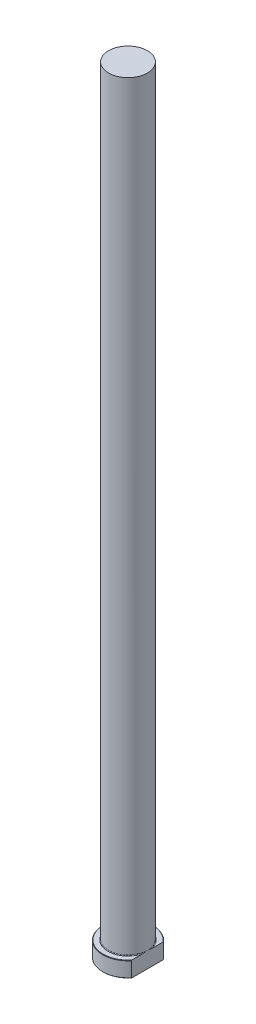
ISO-10303-21;
HEADER;
FILE_DESCRIPTION(('STEP AP214'),'2;1');
FILE_NAME('part.step','',(''),(''),'','','');
FILE_SCHEMA(('AUTOMOTIVE_DESIGN { 1 0 10303 214 1 1 1 1 }'));
ENDSEC;
DATA;
#1=APPLICATION_CONTEXT('core data for automotive mechanical design processes');
#2=APPLICATION_PROTOCOL_DEFINITION('international standard','automotive_design',2000,#1);
#3=PRODUCT_CONTEXT('',#1,'mechanical');
#4=PRODUCT('Part','Part','',(#3));
#5=PRODUCT_RELATED_PRODUCT_CATEGORY('part','',(#4));
#6=PRODUCT_DEFINITION_FORMATION('','',#4);
#7=PRODUCT_DEFINITION_CONTEXT('part definition',#1,'design');
#8=PRODUCT_DEFINITION('design','',#6,#7);
#9=PRODUCT_DEFINITION_SHAPE('','',#8);
#10=(LENGTH_UNIT() NAMED_UNIT(*) SI_UNIT(.MILLI.,.METRE.));
#11=(NAMED_UNIT(*) PLANE_ANGLE_UNIT() SI_UNIT($,.RADIAN.));
#12=(NAMED_UNIT(*) SI_UNIT($,.STERADIAN.) SOLID_ANGLE_UNIT());
#13=UNCERTAINTY_MEASURE_WITH_UNIT(LENGTH_MEASURE(1.E-05),#10,'distance_accuracy_value','');
#14=(GEOMETRIC_REPRESENTATION_CONTEXT(3) GLOBAL_UNCERTAINTY_ASSIGNED_CONTEXT((#13)) GLOBAL_UNIT_ASSIGNED_CONTEXT((#10,
#11,#12)) REPRESENTATION_CONTEXT('',''));
#15=CARTESIAN_POINT('',(0.,0.,0.));
#16=DIRECTION('',(0.,0.,1.));
#17=DIRECTION('',(1.,0.,0.));
#18=AXIS2_PLACEMENT_3D('',#15,#16,#17);
#19=CARTESIAN_POINT('',(0.,0.,0.));
#20=DIRECTION('',(0.,-1.,0.));
#21=DIRECTION('',(0.,0.,-1.));
#22=AXIS2_PLACEMENT_3D('',#19,#20,#21);
#23=PLANE('',#22);
#24=CARTESIAN_POINT('',(0.,0.,0.));
#25=DIRECTION('',(0.,-1.,0.));
#26=DIRECTION('',(0.,0.,-1.));
#27=AXIS2_PLACEMENT_3D('',#24,#25,#26);
#28=CIRCLE('',#27,12.7999999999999);
#29=CARTESIAN_POINT('',(9.99999999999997,0.,7.98999374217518));
#30=VERTEX_POINT('',#29);
#31=CARTESIAN_POINT('',(9.99999999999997,0.,-7.98999374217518));
#32=VERTEX_POINT('',#31);
#33=EDGE_CURVE('E98',#30,#32,#28,.T.);
#34=ORIENTED_EDGE('',*,*,#33,.T.);
#35=DIRECTION('',(0.,0.,1.));
#36=VECTOR('',#35,1.);
#37=CARTESIAN_POINT('',(9.99999999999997,0.,-8.30662386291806));
#38=LINE('',#37,#36);
#39=EDGE_CURVE('E83',#32,#30,#38,.T.);
#40=ORIENTED_EDGE('',*,*,#39,.T.);
#41=EDGE_LOOP('',(#34,#40));
#42=FACE_BOUND('',#41,.T.);
#43=ADVANCED_FACE('F32',(#42),#23,.T.);
#44=CARTESIAN_POINT('',(0.,259.958771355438,0.));
#45=DIRECTION('',(0.,1.,0.));
#46=DIRECTION('',(0.,0.,1.));
#47=AXIS2_PLACEMENT_3D('',#44,#45,#46);
#48=CYLINDRICAL_SURFACE('',#47,13.);
#49=CARTESIAN_POINT('',(0.,7.79999999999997,0.));
#50=DIRECTION('',(0.,1.,0.));
#51=DIRECTION('',(0.,0.,1.));
#52=AXIS2_PLACEMENT_3D('',#49,#50,#51);
#53=CIRCLE('',#52,13.);
#54=CARTESIAN_POINT('',(9.99999999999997,7.79999999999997,8.30662386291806));
#55=VERTEX_POINT('',#54);
#56=CARTESIAN_POINT('',(9.99999999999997,7.79999999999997,-8.30662386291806));
#57=VERTEX_POINT('',#56);
#58=EDGE_CURVE('E104',#55,#57,#53,.F.);
#59=ORIENTED_EDGE('',*,*,#58,.T.);
#60=DIRECTION('',(0.,-1.,0.));
#61=VECTOR('',#60,1.);
#62=CARTESIAN_POINT('',(9.99999999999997,400.,-8.30662386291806));
#63=LINE('',#62,#61);
#64=CARTESIAN_POINT('',(9.99999999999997,0.200000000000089,-8.30662386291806));
#65=VERTEX_POINT('',#64);
#66=EDGE_CURVE('E183',#57,#65,#63,.T.);
#67=ORIENTED_EDGE('',*,*,#66,.T.);
#68=CARTESIAN_POINT('',(0.,0.200000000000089,0.));
#69=DIRECTION('',(0.,-1.,0.));
#70=DIRECTION('',(0.,0.,-1.));
#71=AXIS2_PLACEMENT_3D('',#68,#69,#70);
#72=CIRCLE('',#71,13.);
#73=CARTESIAN_POINT('',(9.99999999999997,0.200000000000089,8.30662386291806));
#74=VERTEX_POINT('',#73);
#75=EDGE_CURVE('E100',#65,#74,#72,.F.);
#76=ORIENTED_EDGE('',*,*,#75,.T.);
#77=DIRECTION('',(0.,-1.,0.));
#78=VECTOR('',#77,1.);
#79=CARTESIAN_POINT('',(9.99999999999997,400.,8.30662386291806));
#80=LINE('',#79,#78);
#81=EDGE_CURVE('E93',#55,#74,#80,.T.);
#82=ORIENTED_EDGE('',*,*,#81,.F.);
#83=EDGE_LOOP('',(#59,#67,#76,#82));
#84=FACE_BOUND('',#83,.T.);
#85=ADVANCED_FACE('F158',(#84),#48,.T.);
#86=CARTESIAN_POINT('',(-13.,8.,0.));
#87=DIRECTION('',(0.,1.,0.));
#88=DIRECTION('',(0.,0.,1.));
#89=AXIS2_PLACEMENT_3D('',#86,#87,#88);
#90=PLANE('',#89);
#91=CARTESIAN_POINT('',(0.,8.,0.));
#92=DIRECTION('',(0.,1.,0.));
#93=DIRECTION('',(0.,0.,1.));
#94=AXIS2_PLACEMENT_3D('',#91,#92,#93);
#95=CIRCLE('',#94,12.8);
#96=CARTESIAN_POINT('',(9.99999999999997,8.,-7.98999374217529));
#97=VERTEX_POINT('',#96);
#98=CARTESIAN_POINT('',(9.99999999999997,8.,7.98999374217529));
#99=VERTEX_POINT('',#98);
#100=EDGE_CURVE('E178',#97,#99,#95,.T.);
#101=ORIENTED_EDGE('',*,*,#100,.T.);
#102=DIRECTION('',(0.,0.,-1.));
#103=VECTOR('',#102,1.);
#104=CARTESIAN_POINT('',(9.99999999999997,8.,0.));
#105=LINE('',#104,#103);
#106=CARTESIAN_POINT('',(9.99999999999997,7.99999999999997,2.46779253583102));
#107=VERTEX_POINT('',#106);
#108=EDGE_CURVE('E57',#99,#107,#105,.T.);
#109=ORIENTED_EDGE('',*,*,#108,.T.);
#110=CARTESIAN_POINT('',(0.,8.,0.));
#111=DIRECTION('',(0.,1.,0.));
#112=DIRECTION('',(0.,0.,1.));
#113=AXIS2_PLACEMENT_3D('',#110,#111,#112);
#114=CIRCLE('',#113,10.3);
#115=CARTESIAN_POINT('',(9.99999999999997,7.99999999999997,-2.4677925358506));
#116=VERTEX_POINT('',#115);
#117=EDGE_CURVE('E107',#107,#116,#114,.F.);
#118=ORIENTED_EDGE('',*,*,#117,.T.);
#119=EDGE_CURVE('E136',#116,#97,#105,.T.);
#120=ORIENTED_EDGE('',*,*,#119,.T.);
#121=EDGE_LOOP('',(#101,#109,#118,#120));
#122=FACE_BOUND('',#121,.T.);
#123=ADVANCED_FACE('F147',(#122),#90,.T.);
#124=CARTESIAN_POINT('',(0.,8.00000000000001,0.));
#125=DIRECTION('',(0.,-1.,0.));
#126=DIRECTION('',(0.,0.,-1.));
#127=AXIS2_PLACEMENT_3D('',#124,#125,#126);
#128=CONICAL_SURFACE('',#127,12.8,0.78539816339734);
#129=ORIENTED_EDGE('',*,*,#58,.F.);
#130=CARTESIAN_POINT('',(9.99999999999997,-0.0325156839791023,18.2754947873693));
#131=CARTESIAN_POINT('',(9.99999999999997,0.202654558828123,18.0074110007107));
#132=CARTESIAN_POINT('',(9.99999999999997,0.437161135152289,17.7387434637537));
#133=CARTESIAN_POINT('',(9.99999999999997,0.90465320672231,17.2000818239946));
#134=CARTESIAN_POINT('',(9.99999999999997,1.1376386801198,16.9300877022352));
#135=CARTESIAN_POINT('',(9.99999999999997,1.60198918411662,16.3885035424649));
#136=CARTESIAN_POINT('',(9.99999999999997,1.83335346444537,16.1169128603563));
#137=CARTESIAN_POINT('',(9.99999999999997,2.29410614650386,15.5720644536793));
#138=CARTESIAN_POINT('',(9.99999999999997,2.52349455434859,15.2988067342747));
#139=CARTESIAN_POINT('',(9.99999999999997,3.21725580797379,14.465453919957));
#140=CARTESIAN_POINT('',(9.99999999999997,3.67808931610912,13.9023903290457));
#141=CARTESIAN_POINT('',(9.99999999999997,4.35978968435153,13.0502618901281));
#142=CARTESIAN_POINT('',(9.99999999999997,4.58540795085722,12.7649943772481));
#143=CARTESIAN_POINT('',(9.99999999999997,5.03290011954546,12.1915402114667));
#144=CARTESIAN_POINT('',(9.99999999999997,5.25477408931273,11.9033536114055));
#145=CARTESIAN_POINT('',(9.99999999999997,5.69431250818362,11.3233226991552));
#146=CARTESIAN_POINT('',(9.99999999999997,5.91197246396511,11.0314749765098));
#147=CARTESIAN_POINT('',(9.99999999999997,6.3419766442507,10.4438760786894));
#148=CARTESIAN_POINT('',(9.99999999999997,6.55432081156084,10.1481248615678));
#149=CARTESIAN_POINT('',(9.99999999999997,6.97275454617,9.55185224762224));
#150=CARTESIAN_POINT('',(9.99999999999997,7.1788387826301,9.25132709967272));
#151=CARTESIAN_POINT('',(9.99999999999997,7.58314110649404,8.6450223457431));
#152=CARTESIAN_POINT('',(9.99999999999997,7.78135936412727,8.33924285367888));
#153=CARTESIAN_POINT('',(9.99999999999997,8.1669913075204,7.72335702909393));
#154=CARTESIAN_POINT('',(9.99999999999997,8.35446043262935,7.41328556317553));
#155=CARTESIAN_POINT('',(9.99999999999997,8.71750578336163,6.78616658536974));
#156=CARTESIAN_POINT('',(9.99999999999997,8.89308056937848,6.46911823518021));
#157=CARTESIAN_POINT('',(9.99999999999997,9.22907765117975,5.82759086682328));
#158=CARTESIAN_POINT('',(9.99999999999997,9.38952050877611,5.50312269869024));
#159=CARTESIAN_POINT('',(9.99999999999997,9.69166927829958,4.84563633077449));
#160=CARTESIAN_POINT('',(9.99999999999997,9.83338220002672,4.5126213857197));
#161=CARTESIAN_POINT('',(9.99999999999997,10.096522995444,3.82962418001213));
#162=CARTESIAN_POINT('',(9.99999999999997,10.2174003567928,3.47942732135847));
#163=CARTESIAN_POINT('',(9.99999999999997,10.4289934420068,2.76986167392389));
#164=CARTESIAN_POINT('',(9.99999999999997,10.5197138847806,2.41049432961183));
#165=CARTESIAN_POINT('',(9.99999999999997,10.6286544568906,1.86748514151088));
#166=CARTESIAN_POINT('',(9.99999999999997,10.6603769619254,1.68649705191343));
#167=CARTESIAN_POINT('',(9.99999999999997,10.7144435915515,1.32313476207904));
#168=CARTESIAN_POINT('',(9.99999999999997,10.7367891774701,1.14076078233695));
#169=CARTESIAN_POINT('',(9.99999999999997,10.7716587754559,0.775084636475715));
#170=CARTESIAN_POINT('',(9.99999999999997,10.7841833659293,0.591782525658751));
#171=CARTESIAN_POINT('',(9.99999999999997,10.7991548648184,0.224764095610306));
#172=CARTESIAN_POINT('',(9.99999999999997,10.8016017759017,0.0410477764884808));
#173=CARTESIAN_POINT('',(9.99999999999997,10.7963538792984,-0.32701731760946));
#174=CARTESIAN_POINT('',(9.99999999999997,10.7886160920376,-0.511365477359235));
#175=CARTESIAN_POINT('',(9.99999999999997,10.7630873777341,-0.879387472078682));
#176=CARTESIAN_POINT('',(9.99999999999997,10.7452949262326,-1.06306120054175));
#177=CARTESIAN_POINT('',(9.99999999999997,10.7000178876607,-1.42920996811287));
#178=CARTESIAN_POINT('',(9.99999999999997,10.6725330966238,-1.61168498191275));
#179=CARTESIAN_POINT('',(9.99999999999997,10.6083992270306,-1.97502817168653));
#180=CARTESIAN_POINT('',(9.99999999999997,10.5717486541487,-2.15589608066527));
#181=CARTESIAN_POINT('',(9.99999999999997,10.4483311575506,-2.69844589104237));
#182=CARTESIAN_POINT('',(9.99999999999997,10.3484702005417,-3.0571987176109));
#183=CARTESIAN_POINT('',(9.99999999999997,10.1199208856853,-3.76518322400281));
#184=CARTESIAN_POINT('',(9.99999999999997,9.99123071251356,-4.11441430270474));
#185=CARTESIAN_POINT('',(9.99999999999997,9.68849468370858,-4.85781703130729));
#186=CARTESIAN_POINT('',(9.99999999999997,9.51049481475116,-5.25036497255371));
#187=CARTESIAN_POINT('',(9.99999999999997,9.13067200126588,-6.0238543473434));
#188=CARTESIAN_POINT('',(9.99999999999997,8.92883580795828,-6.40478917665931));
#189=CARTESIAN_POINT('',(9.99999999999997,8.50660482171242,-7.15714025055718));
#190=CARTESIAN_POINT('',(9.99999999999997,8.28617401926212,-7.52853612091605));
#191=CARTESIAN_POINT('',(9.99999999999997,7.83133827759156,-8.26251132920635));
#192=CARTESIAN_POINT('',(9.99999999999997,7.59693601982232,-8.62509234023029));
#193=CARTESIAN_POINT('',(9.99999999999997,7.11586721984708,-9.34492022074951));
#194=CARTESIAN_POINT('',(9.99999999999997,6.86913954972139,-9.7021260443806));
#195=CARTESIAN_POINT('',(9.99999999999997,6.36695123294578,-10.4103413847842));
#196=CARTESIAN_POINT('',(9.99999999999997,6.11149026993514,-10.7613506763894));
#197=CARTESIAN_POINT('',(9.99999999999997,5.59387477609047,-11.4577672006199));
#198=CARTESIAN_POINT('',(9.99999999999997,5.33172815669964,-11.803180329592));
#199=CARTESIAN_POINT('',(9.99999999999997,4.80177954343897,-12.4896197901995));
#200=CARTESIAN_POINT('',(9.99999999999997,4.53397765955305,-12.8306462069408));
#201=CARTESIAN_POINT('',(9.99999999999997,3.91508653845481,-13.6077378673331));
#202=CARTESIAN_POINT('',(9.99999999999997,3.56244770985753,-14.0425677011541));
#203=CARTESIAN_POINT('',(9.99999999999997,2.85099084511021,-14.9072873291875));
#204=CARTESIAN_POINT('',(9.99999999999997,2.49217148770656,-15.3371760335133));
#205=CARTESIAN_POINT('',(9.99999999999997,1.77449197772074,-16.1870689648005));
#206=CARTESIAN_POINT('',(9.99999999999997,1.41569709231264,-16.607128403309));
#207=CARTESIAN_POINT('',(9.99999999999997,0.694277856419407,-17.4437464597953));
#208=CARTESIAN_POINT('',(9.99999999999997,0.331654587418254,-17.8603060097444));
#209=CARTESIAN_POINT('',(9.99999999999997,-0.0325156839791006,-18.2754947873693));
#210=B_SPLINE_CURVE_WITH_KNOTS('',3,(#130,#131,#132,#133,#134,#135,#136,#137,#138,#139,#140,
#141,#142,#143,#144,#145,#146,#147,#148,#149,#150,#151,#152,#153,#154,#155,#156,#157,#158,#159,
#160,#161,#162,#163,#164,#165,#166,#167,#168,#169,#170,#171,#172,#173,#174,#175,#176,#177,#178,
#179,#180,#181,#182,#183,#184,#185,#186,#187,#188,#189,#190,#191,#192,#193,#194,#195,#196,#197,
#198,#199,#200,#201,#202,#203,#204,#205,#206,#207,#208,#209),.UNSPECIFIED.,.F.,.F.,(4,2,2,2,2,2,
2,2,2,2,2,2,2,2,2,2,2,2,2,2,2,2,2,2,2,2,2,2,2,2,2,2,2,2,2,2,2,2,2,4),(0.,1.06984422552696,
2.13970378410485,3.21002948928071,4.28035188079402,6.46299853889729,7.55408928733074,
8.64516032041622,9.73733693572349,10.8295252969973,11.9226190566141,13.0156891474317,
14.1024911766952,15.1894245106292,16.2748589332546,17.3598859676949,18.4702319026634,
19.5804040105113,20.1314403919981,20.6823908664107,21.2333088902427,21.7842267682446,
22.3374769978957,22.890811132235,23.4441569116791,23.9975929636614,25.1131246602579,
26.2287266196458,27.520697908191,28.8133907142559,30.1086470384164,31.4036555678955,
32.7058891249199,34.0081699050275,35.3089752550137,36.6097553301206,38.2892289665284,
39.9690662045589,41.6263430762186,43.2831636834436),.UNSPECIFIED.);
#211=EDGE_CURVE('E135',#55,#99,#210,.T.);
#212=ORIENTED_EDGE('',*,*,#211,.T.);
#213=ORIENTED_EDGE('',*,*,#100,.F.);
#214=EDGE_CURVE('E127',#97,#57,#210,.T.);
#215=ORIENTED_EDGE('',*,*,#214,.T.);
#216=EDGE_LOOP('',(#129,#212,#213,#215));
#217=FACE_BOUND('',#216,.T.);
#218=ADVANCED_FACE('F143',(#217),#128,.T.);
#219=CARTESIAN_POINT('',(0.,0.200000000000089,0.));
#220=DIRECTION('',(0.,1.,0.));
#221=DIRECTION('',(0.,0.,1.));
#222=AXIS2_PLACEMENT_3D('',#219,#220,#221);
#223=CONICAL_SURFACE('',#222,13.,0.78539816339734);
#224=ORIENTED_EDGE('',*,*,#75,.F.);
#225=CARTESIAN_POINT('',(9.99999999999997,8.03251568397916,-18.2754947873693));
#226=CARTESIAN_POINT('',(9.99999999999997,7.79734544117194,-18.0074110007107));
#227=CARTESIAN_POINT('',(9.99999999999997,7.56283886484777,-17.7387434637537));
#228=CARTESIAN_POINT('',(9.99999999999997,7.09534679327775,-17.2000818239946));
#229=CARTESIAN_POINT('',(9.99999999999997,6.86236131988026,-16.9300877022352));
#230=CARTESIAN_POINT('',(9.99999999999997,6.39801081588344,-16.3885035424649));
#231=CARTESIAN_POINT('',(9.99999999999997,6.1666465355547,-16.1169128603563));
#232=CARTESIAN_POINT('',(9.99999999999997,5.7058938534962,-15.5720644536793));
#233=CARTESIAN_POINT('',(9.99999999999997,5.47650544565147,-15.2988067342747));
#234=CARTESIAN_POINT('',(9.99999999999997,4.78274419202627,-14.465453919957));
#235=CARTESIAN_POINT('',(9.99999999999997,4.32191068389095,-13.9023903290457));
#236=CARTESIAN_POINT('',(9.99999999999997,3.64021031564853,-13.050261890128));
#237=CARTESIAN_POINT('',(9.99999999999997,3.41459204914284,-12.7649943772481));
#238=CARTESIAN_POINT('',(9.99999999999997,2.96709988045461,-12.1915402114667));
#239=CARTESIAN_POINT('',(9.99999999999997,2.74522591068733,-11.9033536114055));
#240=CARTESIAN_POINT('',(9.99999999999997,2.30568749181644,-11.3233226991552));
#241=CARTESIAN_POINT('',(9.99999999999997,2.08802753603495,-11.0314749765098));
#242=CARTESIAN_POINT('',(9.99999999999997,1.65802335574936,-10.4438760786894));
#243=CARTESIAN_POINT('',(9.99999999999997,1.44567918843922,-10.1481248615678));
#244=CARTESIAN_POINT('',(9.99999999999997,1.02724545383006,-9.55185224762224));
#245=CARTESIAN_POINT('',(9.99999999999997,0.821161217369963,-9.25132709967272));
#246=CARTESIAN_POINT('',(9.99999999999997,0.416858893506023,-8.6450223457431));
#247=CARTESIAN_POINT('',(9.99999999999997,0.218640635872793,-8.33924285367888));
#248=CARTESIAN_POINT('',(9.99999999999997,-0.16699130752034,-7.72335702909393));
#249=CARTESIAN_POINT('',(9.99999999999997,-0.354460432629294,-7.41328556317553));
#250=CARTESIAN_POINT('',(9.99999999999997,-0.71750578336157,-6.78616658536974));
#251=CARTESIAN_POINT('',(9.99999999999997,-0.893080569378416,-6.4691182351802));
#252=CARTESIAN_POINT('',(9.99999999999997,-1.22907765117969,-5.82759086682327));
#253=CARTESIAN_POINT('',(9.99999999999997,-1.38952050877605,-5.50312269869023));
#254=CARTESIAN_POINT('',(9.99999999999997,-1.69166927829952,-4.84563633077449));
#255=CARTESIAN_POINT('',(9.99999999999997,-1.83338220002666,-4.5126213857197));
#256=CARTESIAN_POINT('',(9.99999999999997,-2.09652299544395,-3.82962418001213));
#257=CARTESIAN_POINT('',(9.99999999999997,-2.21740035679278,-3.47942732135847));
#258=CARTESIAN_POINT('',(9.99999999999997,-2.4289934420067,-2.76986167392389));
#259=CARTESIAN_POINT('',(9.99999999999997,-2.51971388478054,-2.41049432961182));
#260=CARTESIAN_POINT('',(9.99999999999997,-2.62865445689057,-1.86748514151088));
#261=CARTESIAN_POINT('',(9.99999999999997,-2.66037696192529,-1.68649705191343));
#262=CARTESIAN_POINT('',(9.99999999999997,-2.71444359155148,-1.32313476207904));
#263=CARTESIAN_POINT('',(9.99999999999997,-2.73678917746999,-1.14076078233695));
#264=CARTESIAN_POINT('',(9.99999999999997,-2.77165877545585,-0.775084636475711));
#265=CARTESIAN_POINT('',(9.99999999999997,-2.78418336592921,-0.591782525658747));
#266=CARTESIAN_POINT('',(9.99999999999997,-2.79915486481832,-0.224764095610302));
#267=CARTESIAN_POINT('',(9.99999999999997,-2.80160177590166,-0.0410477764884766));
#268=CARTESIAN_POINT('',(9.99999999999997,-2.79635387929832,0.327017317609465));
#269=CARTESIAN_POINT('',(9.99999999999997,-2.78861609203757,0.51136547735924));
#270=CARTESIAN_POINT('',(9.99999999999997,-2.76308737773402,0.879387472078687));
#271=CARTESIAN_POINT('',(9.99999999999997,-2.74529492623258,1.06306120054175));
#272=CARTESIAN_POINT('',(9.99999999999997,-2.70001788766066,1.42920996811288));
#273=CARTESIAN_POINT('',(9.99999999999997,-2.67253309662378,1.61168498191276));
#274=CARTESIAN_POINT('',(9.99999999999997,-2.60839922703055,1.97502817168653));
#275=CARTESIAN_POINT('',(9.99999999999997,-2.57174865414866,2.15589608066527));
#276=CARTESIAN_POINT('',(9.99999999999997,-2.44833115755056,2.69844589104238));
#277=CARTESIAN_POINT('',(9.99999999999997,-2.34847020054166,3.0571987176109));
#278=CARTESIAN_POINT('',(9.99999999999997,-2.11992088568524,3.76518322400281));
#279=CARTESIAN_POINT('',(9.99999999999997,-1.9912307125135,4.11441430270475));
#280=CARTESIAN_POINT('',(9.99999999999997,-1.68849468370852,4.85781703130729));
#281=CARTESIAN_POINT('',(9.99999999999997,-1.5104948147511,5.25036497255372));
#282=CARTESIAN_POINT('',(9.99999999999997,-1.13067200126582,6.0238543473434));
#283=CARTESIAN_POINT('',(9.99999999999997,-0.928835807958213,6.40478917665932));
#284=CARTESIAN_POINT('',(9.99999999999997,-0.506604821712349,7.15714025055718));
#285=CARTESIAN_POINT('',(9.99999999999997,-0.286174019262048,7.52853612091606));
#286=CARTESIAN_POINT('',(9.99999999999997,0.168661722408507,8.26251132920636));
#287=CARTESIAN_POINT('',(9.99999999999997,0.403063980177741,8.6250923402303));
#288=CARTESIAN_POINT('',(9.99999999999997,0.884132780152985,9.34492022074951));
#289=CARTESIAN_POINT('',(9.99999999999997,1.13086045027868,9.70212604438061));
#290=CARTESIAN_POINT('',(9.99999999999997,1.63304876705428,10.4103413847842));
#291=CARTESIAN_POINT('',(9.99999999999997,1.88850973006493,10.7613506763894));
#292=CARTESIAN_POINT('',(9.99999999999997,2.4061252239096,11.4577672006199));
#293=CARTESIAN_POINT('',(9.99999999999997,2.66827184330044,11.803180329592));
#294=CARTESIAN_POINT('',(9.99999999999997,3.1982204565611,12.4896197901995));
#295=CARTESIAN_POINT('',(9.99999999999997,3.46602234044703,12.8306462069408));
#296=CARTESIAN_POINT('',(9.99999999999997,4.08491346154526,13.6077378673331));
#297=CARTESIAN_POINT('',(9.99999999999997,4.43755229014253,14.0425677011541));
#298=CARTESIAN_POINT('',(9.99999999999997,5.14900915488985,14.9072873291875));
#299=CARTESIAN_POINT('',(9.99999999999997,5.5078285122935,15.3371760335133));
#300=CARTESIAN_POINT('',(9.99999999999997,6.22550802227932,16.1870689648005));
#301=CARTESIAN_POINT('',(9.99999999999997,6.58430290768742,16.607128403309));
#302=CARTESIAN_POINT('',(9.99999999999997,7.30572214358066,17.4437464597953));
#303=CARTESIAN_POINT('',(9.99999999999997,7.66834541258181,17.8603060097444));
#304=CARTESIAN_POINT('',(9.99999999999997,8.03251568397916,18.2754947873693));
#305=B_SPLINE_CURVE_WITH_KNOTS('',3,(#225,#226,#227,#228,#229,#230,#231,#232,#233,#234,#235,
#236,#237,#238,#239,#240,#241,#242,#243,#244,#245,#246,#247,#248,#249,#250,#251,#252,#253,#254,
#255,#256,#257,#258,#259,#260,#261,#262,#263,#264,#265,#266,#267,#268,#269,#270,#271,#272,#273,
#274,#275,#276,#277,#278,#279,#280,#281,#282,#283,#284,#285,#286,#287,#288,#289,#290,#291,#292,
#293,#294,#295,#296,#297,#298,#299,#300,#301,#302,#303,#304),.UNSPECIFIED.,.F.,.F.,(4,2,2,2,2,2,
2,2,2,2,2,2,2,2,2,2,2,2,2,2,2,2,2,2,2,2,2,2,2,2,2,2,2,2,2,2,2,2,2,4),(0.,1.06984422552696,
2.13970378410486,3.21002948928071,4.28035188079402,6.46299853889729,7.55408928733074,
8.64516032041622,9.73733693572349,10.8295252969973,11.9226190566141,13.0156891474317,
14.1024911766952,15.1894245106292,16.2748589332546,17.3598859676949,18.4702319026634,
19.5804040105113,20.1314403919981,20.6823908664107,21.2333088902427,21.7842267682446,
22.3374769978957,22.8908111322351,23.4441569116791,23.9975929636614,25.1131246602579,
26.2287266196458,27.520697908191,28.8133907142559,30.1086470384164,31.4036555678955,
32.7058891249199,34.0081699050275,35.3089752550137,36.6097553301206,38.2892289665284,
39.9690662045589,41.6263430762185,43.2831636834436),.UNSPECIFIED.);
#306=EDGE_CURVE('E86',#65,#32,#305,.T.);
#307=ORIENTED_EDGE('',*,*,#306,.T.);
#308=ORIENTED_EDGE('',*,*,#33,.F.);
#309=EDGE_CURVE('E89',#30,#74,#305,.T.);
#310=ORIENTED_EDGE('',*,*,#309,.T.);
#311=EDGE_LOOP('',(#224,#307,#308,#310));
#312=FACE_BOUND('',#311,.T.);
#313=ADVANCED_FACE('F97',(#312),#223,.T.);
#314=CARTESIAN_POINT('',(0.,8.29999999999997,0.));
#315=DIRECTION('',(0.,1.,0.));
#316=DIRECTION('',(0.,0.,1.));
#317=AXIS2_PLACEMENT_3D('',#314,#315,#316);
#318=TOROIDAL_SURFACE('',#317,10.3,0.3);
#319=CARTESIAN_POINT('',(9.99999999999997,8.29999999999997,0.));
#320=CARTESIAN_POINT('',(9.99999999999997,8.3000006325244,1.2894927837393E-10));
#321=CARTESIAN_POINT('',(9.99999999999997,8.30000126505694,-4.00092931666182E-07));
#322=CARTESIAN_POINT('',(9.99999999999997,8.30000243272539,-1.40234418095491E-06));
#323=CARTESIAN_POINT('',(9.99999999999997,8.30000291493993,-2.02945823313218E-06));
#324=CARTESIAN_POINT('',(9.99999999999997,8.30000399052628,-3.57386628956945E-06));
#325=CARTESIAN_POINT('',(9.99999999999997,8.30000456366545,-4.5158581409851E-06));
#326=CARTESIAN_POINT('',(9.99999999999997,8.30000552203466,-6.39352358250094E-06));
#327=CARTESIAN_POINT('',(9.99999999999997,8.3000059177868,-7.32481303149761E-06));
#328=CARTESIAN_POINT('',(9.99999999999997,8.30000752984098,-1.11866731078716E-05));
#329=CARTESIAN_POINT('',(9.99999999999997,8.30000869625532,-1.41456078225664E-05));
#330=CARTESIAN_POINT('',(9.99999999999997,8.30001046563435,-1.98041770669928E-05));
#331=CARTESIAN_POINT('',(9.99999999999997,8.30001112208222,-2.2487618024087E-05));
#332=CARTESIAN_POINT('',(9.99999999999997,8.30001410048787,-3.44834818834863E-05));
#333=CARTESIAN_POINT('',(9.99999999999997,8.30001652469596,-4.37702043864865E-05));
#334=CARTESIAN_POINT('',(9.99999999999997,8.30001986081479,-6.08623690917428E-05));
#335=CARTESIAN_POINT('',(9.99999999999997,8.30002096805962,-6.86285921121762E-05));
#336=CARTESIAN_POINT('',(9.99999999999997,8.3000293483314,-0.00012805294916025));
#337=CARTESIAN_POINT('',(9.99999999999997,8.30003610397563,-0.000179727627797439));
#338=CARTESIAN_POINT('',(9.99999999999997,8.30006561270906,-0.00038619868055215));
#339=CARTESIAN_POINT('',(9.99999999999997,8.30009331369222,-0.000540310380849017));
#340=CARTESIAN_POINT('',(9.99999999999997,8.30020264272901,-0.00115673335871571));
#341=CARTESIAN_POINT('',(9.99999999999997,8.30028138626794,-0.00161935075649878));
#342=CARTESIAN_POINT('',(9.99999999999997,8.30059961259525,-0.00347761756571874));
#343=CARTESIAN_POINT('',(9.99999999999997,8.30084290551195,-0.0048728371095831));
#344=CARTESIAN_POINT('',(9.99999999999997,8.30186502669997,-0.0107472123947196));
#345=CARTESIAN_POINT('',(9.99999999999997,8.30263902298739,-0.0152269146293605));
#346=CARTESIAN_POINT('',(9.99999999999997,8.31278939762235,-0.0739588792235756));
#347=CARTESIAN_POINT('',(9.99999999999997,8.32219581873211,-0.128207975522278));
#348=CARTESIAN_POINT('',(9.99999999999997,8.34198671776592,-0.242894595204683));
#349=CARTESIAN_POINT('',(9.99999999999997,8.35236068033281,-0.303333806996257));
#350=CARTESIAN_POINT('',(9.99999999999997,8.3697713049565,-0.405616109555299));
#351=CARTESIAN_POINT('',(9.99999999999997,8.3768514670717,-0.447451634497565));
#352=CARTESIAN_POINT('',(9.99999999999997,8.39069208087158,-0.529918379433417));
#353=CARTESIAN_POINT('',(9.99999999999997,8.39745582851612,-0.570549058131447));
#354=CARTESIAN_POINT('',(9.99999999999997,8.4352494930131,-0.799879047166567));
#355=CARTESIAN_POINT('',(9.99999999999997,8.46492511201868,-0.988816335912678));
#356=CARTESIAN_POINT('',(9.99999999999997,8.50514159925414,-1.27416595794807));
#357=CARTESIAN_POINT('',(9.99999999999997,8.51790226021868,-1.37026272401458));
#358=CARTESIAN_POINT('',(9.99999999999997,8.54137601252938,-1.56269877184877));
#359=CARTESIAN_POINT('',(9.99999999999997,8.55208934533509,-1.65903802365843));
#360=CARTESIAN_POINT('',(9.99999999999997,8.57171635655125,-1.86082905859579));
#361=CARTESIAN_POINT('',(9.99999999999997,8.58037484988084,-1.96630619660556));
#362=CARTESIAN_POINT('',(9.99999999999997,8.59347501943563,-2.17764173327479));
#363=CARTESIAN_POINT('',(9.99999999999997,8.59791297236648,-2.28350038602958));
#364=CARTESIAN_POINT('',(9.99999999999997,8.60018116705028,-2.44194031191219));
#365=CARTESIAN_POINT('',(9.99999999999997,8.60021412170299,-2.49449016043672));
#366=CARTESIAN_POINT('',(9.99999999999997,8.5985468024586,-2.59955991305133));
#367=CARTESIAN_POINT('',(9.99999999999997,8.59684676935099,-2.65207982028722));
#368=CARTESIAN_POINT('',(9.99999999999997,8.59132943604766,-2.7569292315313));
#369=CARTESIAN_POINT('',(9.99999999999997,8.58751547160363,-2.80925890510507));
#370=CARTESIAN_POINT('',(9.99999999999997,8.57721394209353,-2.91364681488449));
#371=CARTESIAN_POINT('',(9.99999999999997,8.57072778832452,-2.96570517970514));
#372=CARTESIAN_POINT('',(9.99999999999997,8.55845909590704,-3.04236198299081));
#373=CARTESIAN_POINT('',(9.99999999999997,8.55406015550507,-3.06718232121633));
#374=CARTESIAN_POINT('',(9.99999999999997,8.54426309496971,-3.11664708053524));
#375=CARTESIAN_POINT('',(9.99999999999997,8.53886425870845,-3.14129136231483));
#376=CARTESIAN_POINT('',(9.99999999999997,8.52688550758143,-3.19015398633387));
#377=CARTESIAN_POINT('',(9.99999999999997,8.52031210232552,-3.21437390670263));
#378=CARTESIAN_POINT('',(9.99999999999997,8.50565284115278,-3.26234404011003));
#379=CARTESIAN_POINT('',(9.99999999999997,8.49756823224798,-3.2860946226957));
#380=CARTESIAN_POINT('',(9.99999999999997,8.47930616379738,-3.33303874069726));
#381=CARTESIAN_POINT('',(9.99999999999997,8.46910978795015,-3.35622496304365));
#382=CARTESIAN_POINT('',(9.99999999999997,8.44583688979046,-3.40109767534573));
#383=CARTESIAN_POINT('',(9.99999999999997,8.43277518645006,-3.4227911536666));
#384=CARTESIAN_POINT('',(9.99999999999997,8.41234422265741,-3.44947282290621));
#385=CARTESIAN_POINT('',(9.99999999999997,8.40696910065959,-3.45597309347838));
#386=CARTESIAN_POINT('',(9.99999999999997,8.39560437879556,-3.46843629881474));
#387=CARTESIAN_POINT('',(9.99999999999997,8.38961405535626,-3.47439858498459));
#388=CARTESIAN_POINT('',(9.99999999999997,8.37686927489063,-3.48560282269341));
#389=CARTESIAN_POINT('',(9.99999999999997,8.37010747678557,-3.49083658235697));
#390=CARTESIAN_POINT('',(9.99999999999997,8.3558159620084,-3.50012893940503));
#391=CARTESIAN_POINT('',(9.99999999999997,8.34828839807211,-3.50419071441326));
#392=CARTESIAN_POINT('',(9.99999999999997,8.33495256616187,-3.50966904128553));
#393=CARTESIAN_POINT('',(9.99999999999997,8.32932210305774,-3.5115146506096));
#394=CARTESIAN_POINT('',(9.99999999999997,8.31783314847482,-3.51424608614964));
#395=CARTESIAN_POINT('',(9.99999999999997,8.31197492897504,-3.5151330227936));
#396=CARTESIAN_POINT('',(9.99999999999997,8.30017128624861,-3.51585458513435));
#397=CARTESIAN_POINT('',(9.99999999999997,8.29422562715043,-3.5156854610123));
#398=CARTESIAN_POINT('',(9.99999999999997,8.28245600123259,-3.5143060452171));
#399=CARTESIAN_POINT('',(9.99999999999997,8.2766321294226,-3.51309496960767));
#400=CARTESIAN_POINT('',(9.99999999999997,8.26408629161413,-3.50941038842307));
#401=CARTESIAN_POINT('',(9.99999999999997,8.25742641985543,-3.50672823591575));
#402=CARTESIAN_POINT('',(9.99999999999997,8.2446282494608,-3.50032629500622));
#403=CARTESIAN_POINT('',(9.99999999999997,8.23849100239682,-3.49660447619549));
#404=CARTESIAN_POINT('',(9.99999999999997,8.22322836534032,-3.48593836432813));
#405=CARTESIAN_POINT('',(9.99999999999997,8.21452212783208,-3.47840118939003));
#406=CARTESIAN_POINT('',(9.99999999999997,8.19829740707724,-3.46215047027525));
#407=CARTESIAN_POINT('',(9.99999999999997,8.19078248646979,-3.45343353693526));
#408=CARTESIAN_POINT('',(9.99999999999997,8.16907103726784,-3.42543186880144));
#409=CARTESIAN_POINT('',(9.99999999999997,8.15646161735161,-3.40493410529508));
#410=CARTESIAN_POINT('',(9.99999999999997,8.13394130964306,-3.36256849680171));
#411=CARTESIAN_POINT('',(9.99999999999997,8.12403585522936,-3.34069800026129));
#412=CARTESIAN_POINT('',(9.99999999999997,8.10001076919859,-3.28102790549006));
#413=CARTESIAN_POINT('',(9.99999999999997,8.08762395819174,-3.24253659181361));
#414=CARTESIAN_POINT('',(9.99999999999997,8.06625855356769,-3.16459452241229));
#415=CARTESIAN_POINT('',(9.99999999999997,8.05728845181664,-3.12514163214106));
#416=CARTESIAN_POINT('',(9.99999999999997,8.04173697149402,-3.04517405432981));
#417=CARTESIAN_POINT('',(9.99999999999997,8.03519245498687,-3.00465227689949));
#418=CARTESIAN_POINT('',(9.99999999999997,8.02409415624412,-2.9234105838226));
#419=CARTESIAN_POINT('',(9.99999999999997,8.0195374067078,-2.8826910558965));
#420=CARTESIAN_POINT('',(9.99999999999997,8.00795421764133,-2.7573453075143));
#421=CARTESIAN_POINT('',(9.99999999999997,8.00352270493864,-2.67248037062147));
#422=CARTESIAN_POINT('',(9.99999999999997,7.9993551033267,-2.50262077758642));
#423=CARTESIAN_POINT('',(9.99999999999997,7.99962236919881,-2.41762607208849));
#424=CARTESIAN_POINT('',(9.99999999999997,8.00371104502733,-2.24733475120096));
#425=CARTESIAN_POINT('',(9.99999999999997,8.00754894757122,-2.16203856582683));
#426=CARTESIAN_POINT('',(9.99999999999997,8.01800314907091,-1.99161257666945));
#427=CARTESIAN_POINT('',(9.99999999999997,8.02461987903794,-1.90648280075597));
#428=CARTESIAN_POINT('',(9.99999999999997,8.04643179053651,-1.66587956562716));
#429=CARTESIAN_POINT('',(9.99999999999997,8.06418968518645,-1.51064125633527));
#430=CARTESIAN_POINT('',(9.99999999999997,8.10422160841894,-1.20249798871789));
#431=CARTESIAN_POINT('',(9.99999999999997,8.12644437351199,-1.04958602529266));
#432=CARTESIAN_POINT('',(9.99999999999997,8.15948239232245,-0.836243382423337));
#433=CARTESIAN_POINT('',(9.99999999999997,8.16909985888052,-0.775623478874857));
#434=CARTESIAN_POINT('',(9.99999999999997,8.18897079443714,-0.652687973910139));
#435=CARTESIAN_POINT('',(9.99999999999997,8.1992346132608,-0.590374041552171));
#436=CARTESIAN_POINT('',(9.99999999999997,8.21713663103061,-0.483134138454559));
#437=CARTESIAN_POINT('',(9.99999999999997,8.22471025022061,-0.438197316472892));
#438=CARTESIAN_POINT('',(9.99999999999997,8.2398772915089,-0.348851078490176));
#439=CARTESIAN_POINT('',(9.99999999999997,8.24746951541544,-0.30444145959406));
#440=CARTESIAN_POINT('',(9.99999999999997,8.26182028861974,-0.220832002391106));
#441=CARTESIAN_POINT('',(9.99999999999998,8.26857235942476,-0.181631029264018));
#442=CARTESIAN_POINT('',(9.99999999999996,8.28242621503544,-0.101524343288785));
#443=CARTESIAN_POINT('',(9.99999999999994,8.2895303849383,-0.0606190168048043));
#444=CARTESIAN_POINT('',(9.99999999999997,8.29736053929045,-0.0152203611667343));
#445=CARTESIAN_POINT('',(9.99999999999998,8.29813373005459,-0.0107340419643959));
#446=CARTESIAN_POINT('',(9.99999999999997,8.29916055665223,-0.00485912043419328));
#447=CARTESIAN_POINT('',(9.99999999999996,8.29940456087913,-0.00346907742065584));
#448=CARTESIAN_POINT('',(9.99999999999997,8.29971826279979,-0.00161621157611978));
#449=CARTESIAN_POINT('',(9.99999999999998,8.29979547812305,-0.00115451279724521));
#450=CARTESIAN_POINT('',(9.99999999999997,8.29990750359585,-0.000539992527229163));
#451=CARTESIAN_POINT('',(9.99999999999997,8.29993630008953,-0.00038627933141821));
#452=CARTESIAN_POINT('',(9.99999999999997,8.2999632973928,-0.000179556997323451));
#453=CARTESIAN_POINT('',(9.99999999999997,8.29996909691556,-0.000127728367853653));
#454=CARTESIAN_POINT('',(9.99999999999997,8.29998090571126,-5.92319127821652E-05));
#455=CARTESIAN_POINT('',(9.99999999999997,8.2999842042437,-4.21300594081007E-05));
#456=CARTESIAN_POINT('',(9.99999999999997,8.2999888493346,-2.24947629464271E-05));
#457=CARTESIAN_POINT('',(9.99999999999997,8.29998949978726,-1.98237694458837E-05));
#458=CARTESIAN_POINT('',(9.99999999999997,8.29999127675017,-1.4167154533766E-05));
#459=CARTESIAN_POINT('',(9.99999999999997,8.29999246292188,-1.11998611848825E-05));
#460=CARTESIAN_POINT('',(9.99999999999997,8.29999408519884,-7.32510164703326E-06));
#461=CARTESIAN_POINT('',(9.99999999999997,8.2999944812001,-6.39283781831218E-06));
#462=CARTESIAN_POINT('',(9.99999999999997,8.29999543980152,-4.51302258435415E-06));
#463=CARTESIAN_POINT('',(9.99999999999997,8.2999960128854,-3.56982568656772E-06));
#464=CARTESIAN_POINT('',(9.99999999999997,8.29999708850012,-2.02579406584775E-06));
#465=CARTESIAN_POINT('',(9.99999999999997,8.2999975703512,-1.39989048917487E-06));
#466=CARTESIAN_POINT('',(9.99999999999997,8.29999873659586,-3.99573162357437E-07));
#467=CARTESIAN_POINT('',(9.99999999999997,8.29999936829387,-1.2878245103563E-10));
#468=CARTESIAN_POINT('',(9.99999999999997,8.29999999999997,0.));
#469=B_SPLINE_CURVE_WITH_KNOTS('',3,(#319,#320,#321,#322,#323,#324,#325,#326,#327,#328,#329,
#330,#331,#332,#333,#334,#335,#336,#337,#338,#339,#340,#341,#342,#343,#344,#345,#346,#347,#348,
#349,#350,#351,#352,#353,#354,#355,#356,#357,#358,#359,#360,#361,#362,#363,#364,#365,#366,#367,
#368,#369,#370,#371,#372,#373,#374,#375,#376,#377,#378,#379,#380,#381,#382,#383,#384,#385,#386,
#387,#388,#389,#390,#391,#392,#393,#394,#395,#396,#397,#398,#399,#400,#401,#402,#403,#404,#405,
#406,#407,#408,#409,#410,#411,#412,#413,#414,#415,#416,#417,#418,#419,#420,#421,#422,#423,#424,
#425,#426,#427,#428,#429,#430,#431,#432,#433,#434,#435,#436,#437,#438,#439,#440,#441,#442,#443,
#444,#445,#446,#447,#448,#449,#450,#451,#452,#453,#454,#455,#456,#457,#458,#459,#460,#461,#462,
#463,#464,#465,#466,#467,#468),.UNSPECIFIED.,.T.,.F.,(4,2,2,2,2,2,2,2,2,2,2,2,2,2,2,2,2,2,2,2,2,
2,2,2,2,2,2,2,2,2,2,2,2,2,2,2,2,2,2,2,2,2,2,2,2,2,2,2,2,2,2,2,2,2,2,2,2,2,2,2,2,2,2,2,2,2,2,2,2,
2,2,2,2,2,4),(0.,1.98246532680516E-06,4.40569586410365E-06,7.67776729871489E-06,
1.071537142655E-05,2.02306846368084E-05,2.85109385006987E-05,5.727819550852E-05,
8.07917080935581E-05,0.000237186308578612,0.000706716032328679,0.00211476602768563,
0.00636329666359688,0.0200018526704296,0.18517497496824,0.369144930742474,0.496435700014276,
0.620005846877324,1.19369866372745,1.48450372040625,1.77527445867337,2.09271424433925,
2.41043381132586,2.56806178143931,2.72566785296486,2.88302592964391,3.04030100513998,
3.11590708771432,3.19156753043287,3.26682097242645,3.34201258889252,3.41790937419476,
3.49342251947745,3.51869744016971,3.54400243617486,3.56957226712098,3.5950721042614,
3.61277731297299,3.63046199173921,3.64820950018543,3.66597037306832,3.68738951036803,
3.70885077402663,3.74320167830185,3.77765344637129,3.84944920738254,3.92138819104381,
4.04238665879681,4.16368392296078,4.28675554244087,4.40964280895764,4.66436434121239,
4.91926774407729,5.17535440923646,5.43148080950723,5.90010007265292,6.36361828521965,
6.54775191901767,6.73721153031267,6.87392319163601,7.00908476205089,7.12841975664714,
7.25297120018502,7.26662883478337,7.27086249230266,7.27226698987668,7.27273594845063,
7.27289226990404,7.27294450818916,7.27295274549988,7.27296230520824,7.27296534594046,
7.27296862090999,7.27297104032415,7.27297302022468),.UNSPECIFIED.);
#470=CARTESIAN_POINT('',(9.99999999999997,8.29999999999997,0.));
#471=VERTEX_POINT('',#470);
#472=EDGE_CURVE('E11',#116,#471,#469,.T.);
#473=ORIENTED_EDGE('',*,*,#472,.F.);
#474=ORIENTED_EDGE('',*,*,#117,.F.);
#475=CARTESIAN_POINT('',(9.99999999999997,8.29999999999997,0.));
#476=CARTESIAN_POINT('',(9.99999999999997,8.29999936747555,-1.2894930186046E-10));
#477=CARTESIAN_POINT('',(9.99999999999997,8.29999873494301,4.0009293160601E-07));
#478=CARTESIAN_POINT('',(9.99999999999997,8.29999756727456,1.40234418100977E-06));
#479=CARTESIAN_POINT('',(9.99999999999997,8.29999708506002,2.02945823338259E-06));
#480=CARTESIAN_POINT('',(9.99999999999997,8.29999600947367,3.57386628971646E-06));
#481=CARTESIAN_POINT('',(9.99999999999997,8.2999954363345,4.51585814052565E-06));
#482=CARTESIAN_POINT('',(9.99999999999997,8.29999447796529,6.39352358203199E-06));
#483=CARTESIAN_POINT('',(9.99999999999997,8.29999408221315,7.32481303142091E-06));
#484=CARTESIAN_POINT('',(9.99999999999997,8.29999247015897,1.11866731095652E-05));
#485=CARTESIAN_POINT('',(9.99999999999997,8.29999130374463,1.41456078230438E-05));
#486=CARTESIAN_POINT('',(9.99999999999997,8.2999895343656,1.98041770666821E-05));
#487=CARTESIAN_POINT('',(9.99999999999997,8.29998887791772,2.24876180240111E-05));
#488=CARTESIAN_POINT('',(9.99999999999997,8.29998589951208,3.44834818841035E-05));
#489=CARTESIAN_POINT('',(9.99999999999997,8.29998347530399,4.3770204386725E-05));
#490=CARTESIAN_POINT('',(9.99999999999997,8.29998013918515,6.08623690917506E-05));
#491=CARTESIAN_POINT('',(9.99999999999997,8.29997903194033,6.8628592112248E-05));
#492=CARTESIAN_POINT('',(9.99999999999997,8.29997065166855,0.000128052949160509));
#493=CARTESIAN_POINT('',(9.99999999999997,8.29996389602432,0.000179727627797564));
#494=CARTESIAN_POINT('',(9.99999999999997,8.29993438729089,0.000386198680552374));
#495=CARTESIAN_POINT('',(9.99999999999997,8.29990668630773,0.000540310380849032));
#496=CARTESIAN_POINT('',(9.99999999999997,8.29979735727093,0.00115673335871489));
#497=CARTESIAN_POINT('',(9.99999999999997,8.29971861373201,0.00161935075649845));
#498=CARTESIAN_POINT('',(9.99999999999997,8.29940038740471,0.00347761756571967));
#499=CARTESIAN_POINT('',(9.99999999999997,8.299157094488,0.00487283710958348));
#500=CARTESIAN_POINT('',(9.99999999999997,8.29813497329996,0.0107472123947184));
#501=CARTESIAN_POINT('',(9.99999999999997,8.29736097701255,0.0152269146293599));
#502=CARTESIAN_POINT('',(9.99999999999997,8.28721060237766,0.0739588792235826));
#503=CARTESIAN_POINT('',(9.99999999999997,8.27780418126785,0.128207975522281));
#504=CARTESIAN_POINT('',(9.99999999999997,8.25801328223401,0.242894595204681));
#505=CARTESIAN_POINT('',(9.99999999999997,8.24763931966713,0.303333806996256));
#506=CARTESIAN_POINT('',(9.99999999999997,8.23022869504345,0.405616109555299));
#507=CARTESIAN_POINT('',(9.99999999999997,8.22314853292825,0.447451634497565));
#508=CARTESIAN_POINT('',(9.99999999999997,8.20930791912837,0.529918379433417));
#509=CARTESIAN_POINT('',(9.99999999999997,8.20254417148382,0.570549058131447));
#510=CARTESIAN_POINT('',(9.99999999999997,8.16475050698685,0.799879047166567));
#511=CARTESIAN_POINT('',(9.99999999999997,8.13507488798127,0.988816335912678));
#512=CARTESIAN_POINT('',(9.99999999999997,8.0948584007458,1.27416595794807));
#513=CARTESIAN_POINT('',(9.99999999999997,8.08209773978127,1.37026272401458));
#514=CARTESIAN_POINT('',(9.99999999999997,8.05862398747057,1.56269877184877));
#515=CARTESIAN_POINT('',(9.99999999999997,8.04791065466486,1.65903802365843));
#516=CARTESIAN_POINT('',(9.99999999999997,8.0282836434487,1.86082905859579));
#517=CARTESIAN_POINT('',(9.99999999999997,8.01962515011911,1.96630619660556));
#518=CARTESIAN_POINT('',(9.99999999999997,8.00652498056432,2.17764173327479));
#519=CARTESIAN_POINT('',(9.99999999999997,8.00208702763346,2.28350038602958));
#520=CARTESIAN_POINT('',(9.99999999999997,7.99981883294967,2.44194031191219));
#521=CARTESIAN_POINT('',(9.99999999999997,7.99978587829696,2.49449016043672));
#522=CARTESIAN_POINT('',(9.99999999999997,8.00145319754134,2.59955991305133));
#523=CARTESIAN_POINT('',(9.99999999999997,8.00315323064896,2.65207982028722));
#524=CARTESIAN_POINT('',(9.99999999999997,8.00867056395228,2.7569292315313));
#525=CARTESIAN_POINT('',(9.99999999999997,8.01248452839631,2.80925890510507));
#526=CARTESIAN_POINT('',(9.99999999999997,8.02278605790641,2.91364681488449));
#527=CARTESIAN_POINT('',(9.99999999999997,8.02927221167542,2.96570517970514));
#528=CARTESIAN_POINT('',(9.99999999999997,8.04154090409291,3.04236198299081));
#529=CARTESIAN_POINT('',(9.99999999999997,8.04593984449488,3.06718232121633));
#530=CARTESIAN_POINT('',(9.99999999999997,8.05573690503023,3.11664708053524));
#531=CARTESIAN_POINT('',(9.99999999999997,8.0611357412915,3.14129136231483));
#532=CARTESIAN_POINT('',(9.99999999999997,8.07311449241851,3.19015398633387));
#533=CARTESIAN_POINT('',(9.99999999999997,8.07968789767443,3.21437390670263));
#534=CARTESIAN_POINT('',(9.99999999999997,8.09434715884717,3.26234404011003));
#535=CARTESIAN_POINT('',(9.99999999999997,8.10243176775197,3.2860946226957));
#536=CARTESIAN_POINT('',(9.99999999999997,8.12069383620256,3.33303874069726));
#537=CARTESIAN_POINT('',(9.99999999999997,8.13089021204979,3.35622496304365));
#538=CARTESIAN_POINT('',(9.99999999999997,8.15416311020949,3.40109767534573));
#539=CARTESIAN_POINT('',(9.99999999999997,8.16722481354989,3.4227911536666));
#540=CARTESIAN_POINT('',(9.99999999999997,8.18765577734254,3.44947282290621));
#541=CARTESIAN_POINT('',(9.99999999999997,8.19303089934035,3.45597309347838));
#542=CARTESIAN_POINT('',(9.99999999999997,8.20439562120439,3.46843629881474));
#543=CARTESIAN_POINT('',(9.99999999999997,8.21038594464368,3.47439858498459));
#544=CARTESIAN_POINT('',(9.99999999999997,8.22313072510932,3.48560282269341));
#545=CARTESIAN_POINT('',(9.99999999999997,8.22989252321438,3.49083658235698));
#546=CARTESIAN_POINT('',(9.99999999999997,8.24418403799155,3.50012893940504));
#547=CARTESIAN_POINT('',(9.99999999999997,8.25171160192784,3.50419071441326));
#548=CARTESIAN_POINT('',(9.99999999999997,8.26504743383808,3.50966904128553));
#549=CARTESIAN_POINT('',(9.99999999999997,8.27067789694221,3.5115146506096));
#550=CARTESIAN_POINT('',(9.99999999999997,8.28216685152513,3.51424608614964));
#551=CARTESIAN_POINT('',(9.99999999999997,8.28802507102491,3.5151330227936));
#552=CARTESIAN_POINT('',(9.99999999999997,8.29982871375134,3.51585458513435));
#553=CARTESIAN_POINT('',(9.99999999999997,8.30577437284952,3.5156854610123));
#554=CARTESIAN_POINT('',(9.99999999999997,8.31754399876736,3.5143060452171));
#555=CARTESIAN_POINT('',(9.99999999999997,8.32336787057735,3.51309496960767));
#556=CARTESIAN_POINT('',(9.99999999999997,8.33591370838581,3.50941038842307));
#557=CARTESIAN_POINT('',(9.99999999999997,8.34257358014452,3.50672823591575));
#558=CARTESIAN_POINT('',(9.99999999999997,8.35537175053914,3.50032629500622));
#559=CARTESIAN_POINT('',(9.99999999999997,8.36150899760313,3.49660447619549));
#560=CARTESIAN_POINT('',(9.99999999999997,8.37677163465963,3.48593836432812));
#561=CARTESIAN_POINT('',(9.99999999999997,8.38547787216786,3.47840118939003));
#562=CARTESIAN_POINT('',(9.99999999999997,8.4017025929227,3.46215047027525));
#563=CARTESIAN_POINT('',(9.99999999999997,8.40921751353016,3.45343353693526));
#564=CARTESIAN_POINT('',(9.99999999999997,8.43092896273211,3.42543186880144));
#565=CARTESIAN_POINT('',(9.99999999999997,8.44353838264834,3.40493410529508));
#566=CARTESIAN_POINT('',(9.99999999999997,8.46605869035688,3.36256849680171));
#567=CARTESIAN_POINT('',(9.99999999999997,8.47596414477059,3.34069800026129));
#568=CARTESIAN_POINT('',(9.99999999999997,8.49998923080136,3.28102790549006));
#569=CARTESIAN_POINT('',(9.99999999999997,8.51237604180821,3.24253659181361));
#570=CARTESIAN_POINT('',(9.99999999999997,8.53374144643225,3.16459452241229));
#571=CARTESIAN_POINT('',(9.99999999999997,8.54271154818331,3.12514163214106));
#572=CARTESIAN_POINT('',(9.99999999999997,8.55826302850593,3.04517405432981));
#573=CARTESIAN_POINT('',(9.99999999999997,8.56480754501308,3.00465227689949));
#574=CARTESIAN_POINT('',(9.99999999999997,8.57590584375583,2.9234105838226));
#575=CARTESIAN_POINT('',(9.99999999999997,8.58046259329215,2.8826910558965));
#576=CARTESIAN_POINT('',(9.99999999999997,8.59204578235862,2.7573453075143));
#577=CARTESIAN_POINT('',(9.99999999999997,8.59647729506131,2.67248037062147));
#578=CARTESIAN_POINT('',(9.99999999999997,8.60064489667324,2.50262077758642));
#579=CARTESIAN_POINT('',(9.99999999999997,8.60037763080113,2.41762607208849));
#580=CARTESIAN_POINT('',(9.99999999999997,8.59628895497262,2.24733475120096));
#581=CARTESIAN_POINT('',(9.99999999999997,8.59245105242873,2.16203856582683));
#582=CARTESIAN_POINT('',(9.99999999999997,8.58199685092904,1.99161257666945));
#583=CARTESIAN_POINT('',(9.99999999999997,8.57538012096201,1.90648280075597));
#584=CARTESIAN_POINT('',(9.99999999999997,8.55356820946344,1.66587956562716));
#585=CARTESIAN_POINT('',(9.99999999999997,8.5358103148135,1.51064125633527));
#586=CARTESIAN_POINT('',(9.99999999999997,8.49577839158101,1.20249798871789));
#587=CARTESIAN_POINT('',(9.99999999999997,8.47355562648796,1.04958602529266));
#588=CARTESIAN_POINT('',(9.99999999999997,8.44051760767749,0.836243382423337));
#589=CARTESIAN_POINT('',(9.99999999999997,8.43090014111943,0.775623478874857));
#590=CARTESIAN_POINT('',(9.99999999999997,8.41102920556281,0.652687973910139));
#591=CARTESIAN_POINT('',(9.99999999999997,8.40076538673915,0.59037404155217));
#592=CARTESIAN_POINT('',(9.99999999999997,8.38286336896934,0.483134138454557));
#593=CARTESIAN_POINT('',(9.99999999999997,8.37528974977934,0.43819731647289));
#594=CARTESIAN_POINT('',(9.99999999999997,8.36012270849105,0.348851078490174));
#595=CARTESIAN_POINT('',(9.99999999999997,8.35253048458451,0.304441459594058));
#596=CARTESIAN_POINT('',(9.99999999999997,8.33817971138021,0.220832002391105));
#597=CARTESIAN_POINT('',(9.99999999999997,8.33142764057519,0.181631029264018));
#598=CARTESIAN_POINT('',(9.99999999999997,8.31757378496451,0.101524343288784));
#599=CARTESIAN_POINT('',(9.99999999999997,8.31046961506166,0.0606190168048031));
#600=CARTESIAN_POINT('',(9.99999999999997,8.3026394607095,0.0152203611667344));
#601=CARTESIAN_POINT('',(9.99999999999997,8.30186626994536,0.0107340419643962));
#602=CARTESIAN_POINT('',(9.99999999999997,8.30083944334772,0.0048591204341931));
#603=CARTESIAN_POINT('',(9.99999999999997,8.30059543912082,0.00346907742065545));
#604=CARTESIAN_POINT('',(9.99999999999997,8.30028173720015,0.00161621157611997));
#605=CARTESIAN_POINT('',(9.99999999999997,8.30020452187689,0.00115451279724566));
#606=CARTESIAN_POINT('',(9.99999999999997,8.3000924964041,0.000539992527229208));
#607=CARTESIAN_POINT('',(9.99999999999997,8.30006369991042,0.00038627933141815));
#608=CARTESIAN_POINT('',(9.99999999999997,8.30003670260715,0.000179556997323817));
#609=CARTESIAN_POINT('',(9.99999999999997,8.30003090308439,0.000127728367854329));
#610=CARTESIAN_POINT('',(9.99999999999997,8.30001909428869,5.92319127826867E-05));
#611=CARTESIAN_POINT('',(9.99999999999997,8.30001579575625,4.21300594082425E-05));
#612=CARTESIAN_POINT('',(9.99999999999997,8.30001115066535,2.24947629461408E-05));
#613=CARTESIAN_POINT('',(9.99999999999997,8.30001050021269,1.98237694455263E-05));
#614=CARTESIAN_POINT('',(9.99999999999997,8.30000872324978,1.41671545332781E-05));
#615=CARTESIAN_POINT('',(9.99999999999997,8.30000753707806,1.11998611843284E-05));
#616=CARTESIAN_POINT('',(9.99999999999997,8.30000591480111,7.32510164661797E-06));
#617=CARTESIAN_POINT('',(9.99999999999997,8.30000551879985,6.39283781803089E-06));
#618=CARTESIAN_POINT('',(9.99999999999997,8.30000456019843,4.51302258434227E-06));
#619=CARTESIAN_POINT('',(9.99999999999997,8.30000398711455,3.56982568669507E-06));
#620=CARTESIAN_POINT('',(9.99999999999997,8.30000291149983,2.02579406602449E-06));
#621=CARTESIAN_POINT('',(9.99999999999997,8.30000242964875,1.39989048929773E-06));
#622=CARTESIAN_POINT('',(9.99999999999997,8.30000126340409,3.99573162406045E-07));
#623=CARTESIAN_POINT('',(9.99999999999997,8.30000063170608,1.28782474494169E-10));
#624=CARTESIAN_POINT('',(9.99999999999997,8.29999999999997,0.));
#625=B_SPLINE_CURVE_WITH_KNOTS('',3,(#475,#476,#477,#478,#479,#480,#481,#482,#483,#484,#485,
#486,#487,#488,#489,#490,#491,#492,#493,#494,#495,#496,#497,#498,#499,#500,#501,#502,#503,#504,
#505,#506,#507,#508,#509,#510,#511,#512,#513,#514,#515,#516,#517,#518,#519,#520,#521,#522,#523,
#524,#525,#526,#527,#528,#529,#530,#531,#532,#533,#534,#535,#536,#537,#538,#539,#540,#541,#542,
#543,#544,#545,#546,#547,#548,#549,#550,#551,#552,#553,#554,#555,#556,#557,#558,#559,#560,#561,
#562,#563,#564,#565,#566,#567,#568,#569,#570,#571,#572,#573,#574,#575,#576,#577,#578,#579,#580,
#581,#582,#583,#584,#585,#586,#587,#588,#589,#590,#591,#592,#593,#594,#595,#596,#597,#598,#599,
#600,#601,#602,#603,#604,#605,#606,#607,#608,#609,#610,#611,#612,#613,#614,#615,#616,#617,#618,
#619,#620,#621,#622,#623,#624),.UNSPECIFIED.,.T.,.F.,(4,2,2,2,2,2,2,2,2,2,2,2,2,2,2,2,2,2,2,2,2,
2,2,2,2,2,2,2,2,2,2,2,2,2,2,2,2,2,2,2,2,2,2,2,2,2,2,2,2,2,2,2,2,2,2,2,2,2,2,2,2,2,2,2,2,2,2,2,2,
2,2,2,2,2,4),(0.,1.98246532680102E-06,4.4056958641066E-06,7.67776730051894E-06,
1.07153714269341E-05,2.02306846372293E-05,2.85109385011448E-05,5.72781955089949E-05,
8.07917080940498E-05,0.000237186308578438,0.000706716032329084,0.00211476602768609,
0.00636329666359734,0.0200018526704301,0.185174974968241,0.369144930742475,0.496435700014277,
0.620005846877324,1.19369866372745,1.48450372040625,1.77527445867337,2.09271424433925,
2.41043381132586,2.56806178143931,2.72566785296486,2.88302592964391,3.04030100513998,
3.11590708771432,3.19156753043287,3.26682097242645,3.34201258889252,3.41790937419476,
3.49342251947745,3.51869744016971,3.54400243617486,3.56957226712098,3.5950721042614,
3.61277731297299,3.63046199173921,3.64820950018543,3.66597037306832,3.68738951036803,
3.70885077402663,3.74320167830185,3.77765344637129,3.84944920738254,3.92138819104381,
4.04238665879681,4.16368392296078,4.28675554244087,4.40964280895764,4.66436434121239,
4.91926774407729,5.17535440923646,5.43148080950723,5.90010007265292,6.36361828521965,
6.54775191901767,6.73721153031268,6.87392319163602,7.00908476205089,7.12841975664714,
7.25297120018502,7.26662883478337,7.27086249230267,7.27226698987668,7.27273594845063,
7.27289226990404,7.27294450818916,7.27295274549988,7.27296230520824,7.27296534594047,
7.27296862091,7.27297104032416,7.27297302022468),.UNSPECIFIED.);
#626=EDGE_CURVE('E46',#471,#107,#625,.T.);
#627=ORIENTED_EDGE('',*,*,#626,.F.);
#628=CARTESIAN_POINT('',(0.,8.29999999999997,0.));
#629=DIRECTION('',(0.,1.,0.));
#630=DIRECTION('',(0.,0.,1.));
#631=AXIS2_PLACEMENT_3D('',#628,#629,#630);
#632=CIRCLE('',#631,9.99999999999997);
#633=EDGE_CURVE('E103',#471,#471,#632,.T.);
#634=ORIENTED_EDGE('',*,*,#633,.F.);
#635=EDGE_LOOP('',(#473,#474,#627,#634));
#636=FACE_BOUND('',#635,.T.);
#637=ADVANCED_FACE('F34',(#636),#318,.F.);
#638=CARTESIAN_POINT('',(0.,259.958771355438,0.));
#639=DIRECTION('',(0.,1.,0.));
#640=DIRECTION('',(0.,0.,1.));
#641=AXIS2_PLACEMENT_3D('',#638,#639,#640);
#642=CYLINDRICAL_SURFACE('',#641,9.99999999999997);
#643=ORIENTED_EDGE('',*,*,#633,.T.);
#644=EDGE_LOOP('',(#643));
#645=FACE_BOUND('',#644,.T.);
#646=CARTESIAN_POINT('',(0.,400.,0.));
#647=DIRECTION('',(0.,1.,0.));
#648=DIRECTION('',(0.,0.,1.));
#649=AXIS2_PLACEMENT_3D('',#646,#647,#648);
#650=CIRCLE('',#649,9.99999999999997);
#651=CARTESIAN_POINT('',(0.,400.,9.99999999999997));
#652=VERTEX_POINT('',#651);
#653=EDGE_CURVE('E101',#652,#652,#650,.T.);
#654=ORIENTED_EDGE('',*,*,#653,.F.);
#655=EDGE_LOOP('',(#654));
#656=FACE_BOUND('',#655,.T.);
#657=ADVANCED_FACE('F155',(#645,#656),#642,.T.);
#658=CARTESIAN_POINT('',(-9.99999999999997,400.,0.));
#659=DIRECTION('',(0.,1.,0.));
#660=DIRECTION('',(0.,0.,1.));
#661=AXIS2_PLACEMENT_3D('',#658,#659,#660);
#662=PLANE('',#661);
#663=ORIENTED_EDGE('',*,*,#653,.T.);
#664=EDGE_LOOP('',(#663));
#665=FACE_BOUND('',#664,.T.);
#666=ADVANCED_FACE('F121',(#665),#662,.T.);
#667=CARTESIAN_POINT('',(9.99999999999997,400.,-8.30662386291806));
#668=DIRECTION('',(1.,0.,0.));
#669=DIRECTION('',(0.,0.,-1.));
#670=AXIS2_PLACEMENT_3D('',#667,#668,#669);
#671=PLANE('',#670);
#672=ORIENTED_EDGE('',*,*,#66,.F.);
#673=ORIENTED_EDGE('',*,*,#214,.F.);
#674=ORIENTED_EDGE('',*,*,#119,.F.);
#675=ORIENTED_EDGE('',*,*,#472,.T.);
#676=ORIENTED_EDGE('',*,*,#626,.T.);
#677=ORIENTED_EDGE('',*,*,#108,.F.);
#678=ORIENTED_EDGE('',*,*,#211,.F.);
#679=ORIENTED_EDGE('',*,*,#81,.T.);
#680=ORIENTED_EDGE('',*,*,#309,.F.);
#681=ORIENTED_EDGE('',*,*,#39,.F.);
#682=ORIENTED_EDGE('',*,*,#306,.F.);
#683=EDGE_LOOP('',(#672,#673,#674,#675,#676,#677,#678,#679,#680,#681,#682));
#684=FACE_BOUND('',#683,.T.);
#685=ADVANCED_FACE('F85',(#684),#671,.T.);
#686=CLOSED_SHELL('',(#43,#85,#123,#218,#313,#637,#657,#666,#685));
#687=MANIFOLD_SOLID_BREP('B2',#686);
#688=ADVANCED_BREP_SHAPE_REPRESENTATION('',(#18,#687),#14);
#689=SHAPE_DEFINITION_REPRESENTATION(#9,#688);
ENDSEC;
END-ISO-10303-21;
